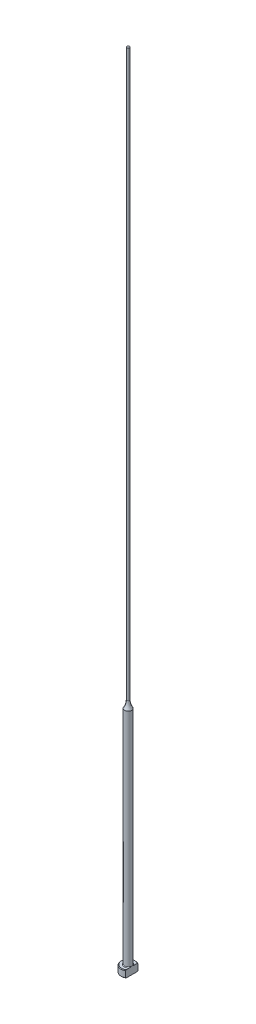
ISO-10303-21;
HEADER;
FILE_DESCRIPTION(('STEP AP214'),'2;1');
FILE_NAME('part.step','',(''),(''),'','','');
FILE_SCHEMA(('AUTOMOTIVE_DESIGN { 1 0 10303 214 1 1 1 1 }'));
ENDSEC;
DATA;
#1=APPLICATION_CONTEXT('core data for automotive mechanical design processes');
#2=APPLICATION_PROTOCOL_DEFINITION('international standard','automotive_design',2000,#1);
#3=PRODUCT_CONTEXT('',#1,'mechanical');
#4=PRODUCT('Part','Part','',(#3));
#5=PRODUCT_RELATED_PRODUCT_CATEGORY('part','',(#4));
#6=PRODUCT_DEFINITION_FORMATION('','',#4);
#7=PRODUCT_DEFINITION_CONTEXT('part definition',#1,'design');
#8=PRODUCT_DEFINITION('design','',#6,#7);
#9=PRODUCT_DEFINITION_SHAPE('','',#8);
#10=(LENGTH_UNIT() NAMED_UNIT(*) SI_UNIT(.MILLI.,.METRE.));
#11=(NAMED_UNIT(*) PLANE_ANGLE_UNIT() SI_UNIT($,.RADIAN.));
#12=(NAMED_UNIT(*) SI_UNIT($,.STERADIAN.) SOLID_ANGLE_UNIT());
#13=UNCERTAINTY_MEASURE_WITH_UNIT(LENGTH_MEASURE(1.E-05),#10,'distance_accuracy_value','');
#14=(GEOMETRIC_REPRESENTATION_CONTEXT(3) GLOBAL_UNCERTAINTY_ASSIGNED_CONTEXT((#13)) GLOBAL_UNIT_ASSIGNED_CONTEXT((#10,
#11,#12)) REPRESENTATION_CONTEXT('',''));
#15=CARTESIAN_POINT('',(0.,0.,0.));
#16=DIRECTION('',(0.,0.,1.));
#17=DIRECTION('',(1.,0.,0.));
#18=AXIS2_PLACEMENT_3D('',#15,#16,#17);
#19=CARTESIAN_POINT('',(-3.17499999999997,3.175,0.));
#20=DIRECTION('',(0.,1.,0.));
#21=DIRECTION('',(0.,0.,1.));
#22=AXIS2_PLACEMENT_3D('',#19,#20,#21);
#23=PLANE('',#22);
#24=CARTESIAN_POINT('',(0.,3.175,0.));
#25=DIRECTION('',(0.,1.,0.));
#26=DIRECTION('',(0.,0.,1.));
#27=AXIS2_PLACEMENT_3D('',#24,#25,#26);
#28=CIRCLE('',#27,2.92099999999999);
#29=CARTESIAN_POINT('',(1.58749999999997,3.175,-2.4519552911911));
#30=VERTEX_POINT('',#29);
#31=CARTESIAN_POINT('',(1.58749999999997,3.175,2.4519552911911));
#32=VERTEX_POINT('',#31);
#33=EDGE_CURVE('E105',#30,#32,#28,.T.);
#34=ORIENTED_EDGE('',*,*,#33,.T.);
#35=DIRECTION('',(0.,0.,1.));
#36=VECTOR('',#35,1.);
#37=CARTESIAN_POINT('',(1.58749999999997,3.17499999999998,2.74963065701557));
#38=LINE('',#37,#36);
#39=CARTESIAN_POINT('',(1.58749999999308,3.175,0.933255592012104));
#40=VERTEX_POINT('',#39);
#41=EDGE_CURVE('E126',#40,#32,#38,.T.);
#42=ORIENTED_EDGE('',*,*,#41,.F.);
#43=CARTESIAN_POINT('',(0.,3.175,0.));
#44=DIRECTION('',(0.,1.,0.));
#45=DIRECTION('',(0.,0.,1.));
#46=AXIS2_PLACEMENT_3D('',#43,#44,#45);
#47=CIRCLE('',#46,1.84149999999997);
#48=CARTESIAN_POINT('',(1.58749999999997,3.17500000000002,-0.933255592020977));
#49=VERTEX_POINT('',#48);
#50=EDGE_CURVE('E11',#40,#49,#47,.F.);
#51=ORIENTED_EDGE('',*,*,#50,.T.);
#52=EDGE_CURVE('E52',#30,#49,#38,.T.);
#53=ORIENTED_EDGE('',*,*,#52,.F.);
#54=EDGE_LOOP('',(#34,#42,#51,#53));
#55=FACE_BOUND('',#54,.T.);
#56=ADVANCED_FACE('F32',(#55),#23,.T.);
#57=CARTESIAN_POINT('',(0.,259.958771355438,0.));
#58=DIRECTION('',(0.,1.,0.));
#59=DIRECTION('',(0.,0.,1.));
#60=AXIS2_PLACEMENT_3D('',#57,#58,#59);
#61=CYLINDRICAL_SURFACE('',#60,3.17499999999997);
#62=CARTESIAN_POINT('',(0.,2.92100000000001,0.));
#63=DIRECTION('',(0.,1.,0.));
#64=DIRECTION('',(0.,0.,1.));
#65=AXIS2_PLACEMENT_3D('',#62,#63,#64);
#66=CIRCLE('',#65,3.17499999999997);
#67=CARTESIAN_POINT('',(1.58749999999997,2.92100000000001,2.74963065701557));
#68=VERTEX_POINT('',#67);
#69=CARTESIAN_POINT('',(1.58749999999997,2.92100000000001,-2.74963065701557));
#70=VERTEX_POINT('',#69);
#71=EDGE_CURVE('E98',#68,#70,#66,.F.);
#72=ORIENTED_EDGE('',*,*,#71,.T.);
#73=DIRECTION('',(0.,-1.,0.));
#74=VECTOR('',#73,1.);
#75=CARTESIAN_POINT('',(1.58749999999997,355.601,-2.74963065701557));
#76=LINE('',#75,#74);
#77=CARTESIAN_POINT('',(1.58749999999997,0.253999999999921,-2.74963065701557));
#78=VERTEX_POINT('',#77);
#79=EDGE_CURVE('E141',#70,#78,#76,.T.);
#80=ORIENTED_EDGE('',*,*,#79,.T.);
#81=CARTESIAN_POINT('',(0.,0.253999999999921,0.));
#82=DIRECTION('',(0.,-1.,0.));
#83=DIRECTION('',(0.,0.,-1.));
#84=AXIS2_PLACEMENT_3D('',#81,#82,#83);
#85=CIRCLE('',#84,3.17499999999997);
#86=CARTESIAN_POINT('',(1.58749999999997,0.253999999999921,2.74963065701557));
#87=VERTEX_POINT('',#86);
#88=EDGE_CURVE('E95',#78,#87,#85,.F.);
#89=ORIENTED_EDGE('',*,*,#88,.T.);
#90=DIRECTION('',(0.,-1.,0.));
#91=VECTOR('',#90,1.);
#92=CARTESIAN_POINT('',(1.58749999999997,355.601,2.74963065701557));
#93=LINE('',#92,#91);
#94=EDGE_CURVE('E88',#68,#87,#93,.T.);
#95=ORIENTED_EDGE('',*,*,#94,.F.);
#96=EDGE_LOOP('',(#72,#80,#89,#95));
#97=FACE_BOUND('',#96,.T.);
#98=ADVANCED_FACE('F191',(#97),#61,.T.);
#99=CARTESIAN_POINT('',(0.,0.,0.));
#100=DIRECTION('',(0.,-1.,0.));
#101=DIRECTION('',(0.,0.,-1.));
#102=AXIS2_PLACEMENT_3D('',#99,#100,#101);
#103=PLANE('',#102);
#104=CARTESIAN_POINT('',(0.,0.,0.));
#105=DIRECTION('',(0.,-1.,0.));
#106=DIRECTION('',(0.,0.,-1.));
#107=AXIS2_PLACEMENT_3D('',#104,#105,#106);
#108=CIRCLE('',#107,2.92100000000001);
#109=CARTESIAN_POINT('',(1.58749999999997,0.,2.45195529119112));
#110=VERTEX_POINT('',#109);
#111=CARTESIAN_POINT('',(1.58749999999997,0.,-2.45195529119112));
#112=VERTEX_POINT('',#111);
#113=EDGE_CURVE('E93',#110,#112,#108,.T.);
#114=ORIENTED_EDGE('',*,*,#113,.T.);
#115=DIRECTION('',(0.,0.,1.));
#116=VECTOR('',#115,1.);
#117=CARTESIAN_POINT('',(1.58749999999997,0.,2.74963065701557));
#118=LINE('',#117,#116);
#119=EDGE_CURVE('E78',#112,#110,#118,.T.);
#120=ORIENTED_EDGE('',*,*,#119,.T.);
#121=EDGE_LOOP('',(#114,#120));
#122=FACE_BOUND('',#121,.T.);
#123=ADVANCED_FACE('F97',(#122),#103,.T.);
#124=CARTESIAN_POINT('',(0.,3.17499999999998,0.));
#125=DIRECTION('',(0.,-1.,0.));
#126=DIRECTION('',(0.,0.,-1.));
#127=AXIS2_PLACEMENT_3D('',#124,#125,#126);
#128=CONICAL_SURFACE('',#127,2.92100000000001,0.785398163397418);
#129=ORIENTED_EDGE('',*,*,#71,.F.);
#130=CARTESIAN_POINT('',(1.58749999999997,-0.161620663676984,-6.0529050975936));
#131=CARTESIAN_POINT('',(1.58749999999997,-0.0288893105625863,-5.91567682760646));
#132=CARTESIAN_POINT('',(1.58749999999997,0.103699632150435,-5.77831035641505));
#133=CARTESIAN_POINT('',(1.58749999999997,0.368508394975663,-5.50321874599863));
#134=CARTESIAN_POINT('',(1.58749999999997,0.5007282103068,-5.3654936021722));
#135=CARTESIAN_POINT('',(1.58749999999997,0.764778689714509,-5.08953516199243));
#136=CARTESIAN_POINT('',(1.58749999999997,0.896609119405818,-4.95130164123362));
#137=CARTESIAN_POINT('',(1.58749999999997,1.15968706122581,-4.67428233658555));
#138=CARTESIAN_POINT('',(1.58749999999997,1.29093457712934,-4.5354965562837));
#139=CARTESIAN_POINT('',(1.58749999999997,1.55007705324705,-4.25997724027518));
#140=CARTESIAN_POINT('',(1.58749999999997,1.67798684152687,-4.12325766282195));
#141=CARTESIAN_POINT('',(1.58749999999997,1.9328486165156,-3.84892898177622));
#142=CARTESIAN_POINT('',(1.58749999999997,2.05980060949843,-3.71131988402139));
#143=CARTESIAN_POINT('',(1.58749999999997,2.31237508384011,-3.43493978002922));
#144=CARTESIAN_POINT('',(1.58749999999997,2.43799784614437,-3.29616903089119));
#145=CARTESIAN_POINT('',(1.58749999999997,2.68741369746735,-3.01699558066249));
#146=CARTESIAN_POINT('',(1.58749999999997,2.81120686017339,-2.8765929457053));
#147=CARTESIAN_POINT('',(1.58749999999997,3.00875865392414,-2.64816703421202));
#148=CARTESIAN_POINT('',(1.58749999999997,3.08336151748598,-2.56087478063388));
#149=CARTESIAN_POINT('',(1.58749999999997,3.23123871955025,-2.385154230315));
#150=CARTESIAN_POINT('',(1.58749999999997,3.30451292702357,-2.29672582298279));
#151=CARTESIAN_POINT('',(1.58749999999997,3.45004422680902,-2.11747400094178));
#152=CARTESIAN_POINT('',(1.58749999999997,3.52228237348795,-2.02663514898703));
#153=CARTESIAN_POINT('',(1.58749999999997,3.66423097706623,-1.84302524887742));
#154=CARTESIAN_POINT('',(1.58749999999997,3.73394203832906,-1.75025467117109));
#155=CARTESIAN_POINT('',(1.58749999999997,3.87080633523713,-1.56067475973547));
#156=CARTESIAN_POINT('',(1.58749999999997,3.93790459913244,-1.46382547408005));
#157=CARTESIAN_POINT('',(1.58749999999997,4.06669147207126,-1.26632594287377));
#158=CARTESIAN_POINT('',(1.58749999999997,4.12837264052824,-1.16567073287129));
#159=CARTESIAN_POINT('',(1.58749999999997,4.21402252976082,-1.01165766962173));
#160=CARTESIAN_POINT('',(1.58749999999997,4.2412792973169,-0.960142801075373));
#161=CARTESIAN_POINT('',(1.58749999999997,4.29309798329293,-0.85578092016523));
#162=CARTESIAN_POINT('',(1.58749999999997,4.3176594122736,-0.802933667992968));
#163=CARTESIAN_POINT('',(1.58749999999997,4.38614656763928,-0.642461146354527));
#164=CARTESIAN_POINT('',(1.58749999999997,4.42510149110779,-0.532518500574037));
#165=CARTESIAN_POINT('',(1.58749999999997,4.46726244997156,-0.367680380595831));
#166=CARTESIAN_POINT('',(1.58749999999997,4.47844427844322,-0.314802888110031));
#167=CARTESIAN_POINT('',(1.58749999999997,4.49576654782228,-0.208209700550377));
#168=CARTESIAN_POINT('',(1.58749999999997,4.50190743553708,-0.154494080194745));
#169=CARTESIAN_POINT('',(1.58749999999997,4.50871296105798,-0.0468792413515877));
#170=CARTESIAN_POINT('',(1.58749999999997,4.50939451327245,0.00701889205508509));
#171=CARTESIAN_POINT('',(1.58749999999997,4.5052767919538,0.114606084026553));
#172=CARTESIAN_POINT('',(1.58749999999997,4.5004770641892,0.16829512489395));
#173=CARTESIAN_POINT('',(1.58749999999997,4.48579689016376,0.274485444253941));
#174=CARTESIAN_POINT('',(1.58749999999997,4.47596081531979,0.326992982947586));
#175=CARTESIAN_POINT('',(1.58749999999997,4.4518180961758,0.430974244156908));
#176=CARTESIAN_POINT('',(1.58749999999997,4.43750969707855,0.482447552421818));
#177=CARTESIAN_POINT('',(1.58749999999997,4.40502489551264,0.58446088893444));
#178=CARTESIAN_POINT('',(1.58749999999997,4.38682724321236,0.634994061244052));
#179=CARTESIAN_POINT('',(1.58749999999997,4.34729308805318,0.734789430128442));
#180=CARTESIAN_POINT('',(1.58749999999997,4.32595722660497,0.784051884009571));
#181=CARTESIAN_POINT('',(1.58749999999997,4.25791922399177,0.93054934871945));
#182=CARTESIAN_POINT('',(1.58749999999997,4.20736047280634,1.02598802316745));
#183=CARTESIAN_POINT('',(1.58749999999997,4.09955451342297,1.21304313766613));
#184=CARTESIAN_POINT('',(1.58749999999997,4.04229912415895,1.30465471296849));
#185=CARTESIAN_POINT('',(1.58749999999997,3.92308746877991,1.48526211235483));
#186=CARTESIAN_POINT('',(1.58749999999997,3.86111349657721,1.57424615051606));
#187=CARTESIAN_POINT('',(1.58749999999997,3.73408621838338,1.74990003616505));
#188=CARTESIAN_POINT('',(1.58749999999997,3.66903444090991,1.83657099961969));
#189=CARTESIAN_POINT('',(1.58749999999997,3.53583371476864,2.009317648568));
#190=CARTESIAN_POINT('',(1.58749999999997,3.46765527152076,2.09537048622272));
#191=CARTESIAN_POINT('',(1.58749999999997,3.32960643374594,2.26611736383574));
#192=CARTESIAN_POINT('',(1.58749999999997,3.25973586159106,2.35081125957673));
#193=CARTESIAN_POINT('',(1.58749999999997,3.04858139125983,2.60290121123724));
#194=CARTESIAN_POINT('',(1.58749999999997,2.90542388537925,2.7687253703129));
#195=CARTESIAN_POINT('',(1.58749999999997,2.64069522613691,3.06970913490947));
#196=CARTESIAN_POINT('',(1.58749999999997,2.5195945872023,3.20528660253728));
#197=CARTESIAN_POINT('',(1.58749999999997,2.27590400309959,3.47510321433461));
#198=CARTESIAN_POINT('',(1.58749999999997,2.1533140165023,3.60934232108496));
#199=CARTESIAN_POINT('',(1.58749999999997,1.9069423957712,3.87695374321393));
#200=CARTESIAN_POINT('',(1.58749999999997,1.78315974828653,4.01032512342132));
#201=CARTESIAN_POINT('',(1.58749999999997,1.53478104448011,4.2763088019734));
#202=CARTESIAN_POINT('',(1.58749999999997,1.41018498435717,4.40892109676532));
#203=CARTESIAN_POINT('',(1.58749999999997,1.04574684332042,4.79499418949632));
#204=CARTESIAN_POINT('',(1.58749999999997,0.805076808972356,5.04767313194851));
#205=CARTESIAN_POINT('',(1.58749999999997,0.44312150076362,5.42550911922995));
#206=CARTESIAN_POINT('',(1.58749999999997,0.322378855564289,5.55118772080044));
#207=CARTESIAN_POINT('',(1.58749999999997,0.0805914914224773,5.8022520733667));
#208=CARTESIAN_POINT('',(1.58749999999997,-0.0404532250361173,5.92763782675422));
#209=CARTESIAN_POINT('',(1.58749999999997,-0.161620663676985,6.0529050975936));
#210=B_SPLINE_CURVE_WITH_KNOTS('',3,(#130,#131,#132,#133,#134,#135,#136,#137,#138,#139,#140,
#141,#142,#143,#144,#145,#146,#147,#148,#149,#150,#151,#152,#153,#154,#155,#156,#157,#158,#159,
#160,#161,#162,#163,#164,#165,#166,#167,#168,#169,#170,#171,#172,#173,#174,#175,#176,#177,#178,
#179,#180,#181,#182,#183,#184,#185,#186,#187,#188,#189,#190,#191,#192,#193,#194,#195,#196,#197,
#198,#199,#200,#201,#202,#203,#204,#205,#206,#207,#208,#209),.UNSPECIFIED.,.F.,.F.,(4,2,2,2,2,2,
2,2,2,2,2,2,2,2,2,2,2,2,2,2,2,2,2,2,2,2,2,2,2,2,2,2,2,2,2,2,2,2,2,4),(0.,0.572750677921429,
1.14550874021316,1.71856057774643,2.29160869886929,2.85328006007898,3.41494773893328,
3.97649423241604,4.53801804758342,4.88249307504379,5.2270018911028,5.57515326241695,
5.92322081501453,6.27657800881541,6.63041319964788,6.80518126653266,6.97998101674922,
7.32824262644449,7.49018491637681,7.65211285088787,7.81353889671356,7.97497832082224,
8.13501929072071,8.29512313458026,8.45612518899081,8.61709438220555,8.94062993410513,
9.26456495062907,9.58978187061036,9.91483894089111,10.2441741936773,10.5735441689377,
11.2306812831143,11.7760337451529,12.3214014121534,12.8672825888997,13.4131663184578,
14.4600164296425,14.9828595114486,15.505698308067),.UNSPECIFIED.);
#211=EDGE_CURVE('E118',#32,#68,#210,.T.);
#212=ORIENTED_EDGE('',*,*,#211,.F.);
#213=ORIENTED_EDGE('',*,*,#33,.F.);
#214=EDGE_CURVE('E117',#70,#30,#210,.T.);
#215=ORIENTED_EDGE('',*,*,#214,.F.);
#216=EDGE_LOOP('',(#129,#212,#213,#215));
#217=FACE_BOUND('',#216,.T.);
#218=ADVANCED_FACE('F162',(#217),#128,.T.);
#219=CARTESIAN_POINT('',(0.,0.253999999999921,0.));
#220=DIRECTION('',(0.,1.,0.));
#221=DIRECTION('',(0.,0.,1.));
#222=AXIS2_PLACEMENT_3D('',#219,#220,#221);
#223=CONICAL_SURFACE('',#222,3.17499999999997,0.785398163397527);
#224=ORIENTED_EDGE('',*,*,#88,.F.);
#225=CARTESIAN_POINT('',(1.58749999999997,3.33662066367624,6.0529050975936));
#226=CARTESIAN_POINT('',(1.58749999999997,3.20388931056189,5.91567682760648));
#227=CARTESIAN_POINT('',(1.58749999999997,3.07130036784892,5.7783103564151));
#228=CARTESIAN_POINT('',(1.58749999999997,2.80649160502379,5.50321874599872));
#229=CARTESIAN_POINT('',(1.58749999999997,2.6742717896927,5.36549360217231));
#230=CARTESIAN_POINT('',(1.58749999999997,2.41022131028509,5.08953516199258));
#231=CARTESIAN_POINT('',(1.58749999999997,2.27839088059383,4.95130164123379));
#232=CARTESIAN_POINT('',(1.58749999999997,2.01531293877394,4.67428233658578));
#233=CARTESIAN_POINT('',(1.58749999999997,1.88406542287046,4.53549655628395));
#234=CARTESIAN_POINT('',(1.58749999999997,1.62492294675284,4.25997724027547));
#235=CARTESIAN_POINT('',(1.58749999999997,1.49701315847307,4.12325766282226));
#236=CARTESIAN_POINT('',(1.58749999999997,1.24215138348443,3.84892898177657));
#237=CARTESIAN_POINT('',(1.58749999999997,1.11519939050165,3.71131988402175));
#238=CARTESIAN_POINT('',(1.58749999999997,0.862624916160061,3.43493978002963));
#239=CARTESIAN_POINT('',(1.58749999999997,0.737002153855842,3.29616903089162));
#240=CARTESIAN_POINT('',(1.58749999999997,0.487586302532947,3.01699558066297));
#241=CARTESIAN_POINT('',(1.58749999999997,0.363793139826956,2.8765929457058));
#242=CARTESIAN_POINT('',(1.58749999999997,0.166241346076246,2.64816703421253));
#243=CARTESIAN_POINT('',(1.58749999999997,0.0916384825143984,2.56087478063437));
#244=CARTESIAN_POINT('',(1.58749999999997,-0.0562387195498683,2.38515423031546));
#245=CARTESIAN_POINT('',(1.58749999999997,-0.129512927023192,2.29672582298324));
#246=CARTESIAN_POINT('',(1.58749999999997,-0.275044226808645,2.1174740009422));
#247=CARTESIAN_POINT('',(1.58749999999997,-0.347282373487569,2.02663514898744));
#248=CARTESIAN_POINT('',(1.58749999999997,-0.489230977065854,1.8430252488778));
#249=CARTESIAN_POINT('',(1.58749999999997,-0.558942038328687,1.75025467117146));
#250=CARTESIAN_POINT('',(1.58749999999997,-0.695806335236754,1.5606747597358));
#251=CARTESIAN_POINT('',(1.58749999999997,-0.762904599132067,1.46382547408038));
#252=CARTESIAN_POINT('',(1.58749999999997,-0.89169147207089,1.26632594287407));
#253=CARTESIAN_POINT('',(1.58749999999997,-0.953372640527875,1.16567073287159));
#254=CARTESIAN_POINT('',(1.58749999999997,-1.03902252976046,1.01165766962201));
#255=CARTESIAN_POINT('',(1.58749999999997,-1.06627929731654,0.960142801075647));
#256=CARTESIAN_POINT('',(1.58749999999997,-1.11809798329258,0.855780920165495));
#257=CARTESIAN_POINT('',(1.58749999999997,-1.14265941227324,0.802933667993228));
#258=CARTESIAN_POINT('',(1.58749999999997,-1.21114656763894,0.642461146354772));
#259=CARTESIAN_POINT('',(1.58749999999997,-1.25010149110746,0.532518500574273));
#260=CARTESIAN_POINT('',(1.58749999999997,-1.29226244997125,0.367680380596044));
#261=CARTESIAN_POINT('',(1.58749999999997,-1.30344427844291,0.314802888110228));
#262=CARTESIAN_POINT('',(1.58749999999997,-1.32076654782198,0.208209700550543));
#263=CARTESIAN_POINT('',(1.58749999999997,-1.32690743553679,0.154494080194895));
#264=CARTESIAN_POINT('',(1.58749999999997,-1.3337129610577,0.0468792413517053));
#265=CARTESIAN_POINT('',(1.58749999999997,-1.33439451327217,-0.00701889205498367));
#266=CARTESIAN_POINT('',(1.58749999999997,-1.33027679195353,-0.114606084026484));
#267=CARTESIAN_POINT('',(1.58749999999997,-1.32547706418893,-0.168295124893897));
#268=CARTESIAN_POINT('',(1.58749999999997,-1.31079689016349,-0.274485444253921));
#269=CARTESIAN_POINT('',(1.58749999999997,-1.30096081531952,-0.326992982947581));
#270=CARTESIAN_POINT('',(1.58749999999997,-1.27681809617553,-0.430974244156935));
#271=CARTESIAN_POINT('',(1.58749999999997,-1.26250969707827,-0.48244755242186));
#272=CARTESIAN_POINT('',(1.58749999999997,-1.23002489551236,-0.584460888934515));
#273=CARTESIAN_POINT('',(1.58749999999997,-1.21182724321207,-0.634994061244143));
#274=CARTESIAN_POINT('',(1.58749999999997,-1.17229308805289,-0.734789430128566));
#275=CARTESIAN_POINT('',(1.58749999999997,-1.15095722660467,-0.784051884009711));
#276=CARTESIAN_POINT('',(1.58749999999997,-1.08291922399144,-0.930549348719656));
#277=CARTESIAN_POINT('',(1.58749999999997,-1.03236047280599,-1.0259880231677));
#278=CARTESIAN_POINT('',(1.58749999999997,-0.924554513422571,-1.21304313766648));
#279=CARTESIAN_POINT('',(1.58749999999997,-0.867299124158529,-1.30465471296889));
#280=CARTESIAN_POINT('',(1.58749999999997,-0.748087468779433,-1.48526211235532));
#281=CARTESIAN_POINT('',(1.58749999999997,-0.686113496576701,-1.5742461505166));
#282=CARTESIAN_POINT('',(1.58749999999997,-0.559086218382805,-1.74990003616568));
#283=CARTESIAN_POINT('',(1.58749999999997,-0.494034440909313,-1.83657099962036));
#284=CARTESIAN_POINT('',(1.58749999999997,-0.360833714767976,-2.00931764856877));
#285=CARTESIAN_POINT('',(1.58749999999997,-0.292655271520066,-2.09537048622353));
#286=CARTESIAN_POINT('',(1.58749999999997,-0.154606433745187,-2.26611736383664));
#287=CARTESIAN_POINT('',(1.58749999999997,-0.0847358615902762,-2.35081125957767));
#288=CARTESIAN_POINT('',(1.58749999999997,0.126418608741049,-2.60290121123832));
#289=CARTESIAN_POINT('',(1.58749999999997,0.269576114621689,-2.76872537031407));
#290=CARTESIAN_POINT('',(1.58749999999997,0.534304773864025,-3.06970913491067));
#291=CARTESIAN_POINT('',(1.58749999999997,0.655405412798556,-3.20528660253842));
#292=CARTESIAN_POINT('',(1.58749999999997,0.899095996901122,-3.47510321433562));
#293=CARTESIAN_POINT('',(1.58749999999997,1.02168598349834,-3.60934232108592));
#294=CARTESIAN_POINT('',(1.58749999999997,1.26805760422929,-3.87695374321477));
#295=CARTESIAN_POINT('',(1.58749999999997,1.39184025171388,-4.0103251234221));
#296=CARTESIAN_POINT('',(1.58749999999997,1.64021895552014,-4.27630880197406));
#297=CARTESIAN_POINT('',(1.58749999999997,1.76481501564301,-4.40892109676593));
#298=CARTESIAN_POINT('',(1.58749999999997,2.12925315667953,-4.79499418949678));
#299=CARTESIAN_POINT('',(1.58749999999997,2.36992319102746,-5.04767313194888));
#300=CARTESIAN_POINT('',(1.58749999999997,2.73187849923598,-5.42550911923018));
#301=CARTESIAN_POINT('',(1.58749999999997,2.85262114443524,-5.55118772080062));
#302=CARTESIAN_POINT('',(1.58749999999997,3.09440850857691,-5.80225207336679));
#303=CARTESIAN_POINT('',(1.58749999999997,3.21545322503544,-5.92763782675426));
#304=CARTESIAN_POINT('',(1.58749999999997,3.33662066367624,-6.0529050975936));
#305=B_SPLINE_CURVE_WITH_KNOTS('',3,(#225,#226,#227,#228,#229,#230,#231,#232,#233,#234,#235,
#236,#237,#238,#239,#240,#241,#242,#243,#244,#245,#246,#247,#248,#249,#250,#251,#252,#253,#254,
#255,#256,#257,#258,#259,#260,#261,#262,#263,#264,#265,#266,#267,#268,#269,#270,#271,#272,#273,
#274,#275,#276,#277,#278,#279,#280,#281,#282,#283,#284,#285,#286,#287,#288,#289,#290,#291,#292,
#293,#294,#295,#296,#297,#298,#299,#300,#301,#302,#303,#304),.UNSPECIFIED.,.F.,.F.,(4,2,2,2,2,2,
2,2,2,2,2,2,2,2,2,2,2,2,2,2,2,2,2,2,2,2,2,2,2,2,2,2,2,2,2,2,2,2,2,4),(0.,0.572750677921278,
1.14550874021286,1.71856057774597,2.29160869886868,2.85328006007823,3.4149477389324,
3.97649423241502,4.53801804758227,4.88249307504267,5.22700189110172,5.5751532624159,
5.92322081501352,6.27657800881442,6.63041319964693,6.80518126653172,6.9799810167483,
7.3282426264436,7.49018491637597,7.65211285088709,7.81353889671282,7.97497832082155,
8.13501929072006,8.29512313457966,8.45612518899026,8.61709438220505,8.9406299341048,
9.2645649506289,9.58978187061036,9.91483894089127,10.2441741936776,10.5735441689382,
11.2306812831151,11.7760337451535,12.3214014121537,12.8672825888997,13.4131663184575,
14.4600164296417,14.9828595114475,15.5056983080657),.UNSPECIFIED.);
#306=EDGE_CURVE('E81',#112,#78,#305,.T.);
#307=ORIENTED_EDGE('',*,*,#306,.F.);
#308=ORIENTED_EDGE('',*,*,#113,.F.);
#309=EDGE_CURVE('E84',#87,#110,#305,.T.);
#310=ORIENTED_EDGE('',*,*,#309,.F.);
#311=EDGE_LOOP('',(#224,#307,#308,#310));
#312=FACE_BOUND('',#311,.T.);
#313=ADVANCED_FACE('F92',(#312),#223,.T.);
#314=CARTESIAN_POINT('',(0.,3.42900000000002,0.));
#315=DIRECTION('',(0.,1.,0.));
#316=DIRECTION('',(0.,0.,1.));
#317=AXIS2_PLACEMENT_3D('',#314,#315,#316);
#318=TOROIDAL_SURFACE('',#317,1.84149999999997,0.254);
#319=CARTESIAN_POINT('',(1.58749999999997,3.42900000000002,0.));
#320=CARTESIAN_POINT('',(1.58749999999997,3.42899942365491,-1.9220514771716E-10));
#321=CARTESIAN_POINT('',(1.58749999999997,3.42899884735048,-1.2261161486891E-07));
#322=CARTESIAN_POINT('',(1.58749999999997,3.42899773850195,-5.09676365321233E-07));
#323=CARTESIAN_POINT('',(1.58749999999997,3.42899720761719,-7.78176328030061E-07));
#324=CARTESIAN_POINT('',(1.58749999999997,3.42899614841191,-1.42307272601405E-06));
#325=CARTESIAN_POINT('',(1.58749999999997,3.42899562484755,-1.80713867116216E-06));
#326=CARTESIAN_POINT('',(1.58749999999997,3.42899463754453,-2.63494846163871E-06));
#327=CARTESIAN_POINT('',(1.58749999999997,3.42899417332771,-3.07814756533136E-06));
#328=CARTESIAN_POINT('',(1.58749999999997,3.42899261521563,-4.66897357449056E-06));
#329=CARTESIAN_POINT('',(1.58749999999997,3.42899159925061,-5.89404908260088E-06));
#330=CARTESIAN_POINT('',(1.58749999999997,3.42898979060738,-8.42427511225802E-06));
#331=CARTESIAN_POINT('',(1.58749999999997,3.42898899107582,-9.7248057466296E-06));
#332=CARTESIAN_POINT('',(1.58749999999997,3.42898598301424,-1.48060601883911E-05));
#333=CARTESIAN_POINT('',(1.58749999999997,3.42898393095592,-1.86838281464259E-05));
#334=CARTESIAN_POINT('',(1.58749999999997,3.42898057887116,-2.63261117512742E-05));
#335=CARTESIAN_POINT('',(1.58749999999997,3.42897922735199,-3.00687417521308E-05));
#336=CARTESIAN_POINT('',(1.58749999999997,3.42897347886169,-4.60276298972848E-05));
#337=CARTESIAN_POINT('',(1.58749999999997,3.42896911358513,-5.8247019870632E-05));
#338=CARTESIAN_POINT('',(1.58749999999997,3.42896211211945,-8.11070097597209E-05));
#339=CARTESIAN_POINT('',(1.58749999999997,3.42895931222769,-9.16953114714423E-05));
#340=CARTESIAN_POINT('',(1.58749999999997,3.42893712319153,-0.000168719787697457));
#341=CARTESIAN_POINT('',(1.58749999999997,3.42890881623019,-0.000232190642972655));
#342=CARTESIAN_POINT('',(1.58749999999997,3.42880276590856,-0.000479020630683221));
#343=CARTESIAN_POINT('',(1.58749999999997,3.42873165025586,-0.00066443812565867));
#344=CARTESIAN_POINT('',(1.58749999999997,3.42845137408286,-0.0013844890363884));
#345=CARTESIAN_POINT('',(1.58749999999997,3.42823526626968,-0.00191701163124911));
#346=CARTESIAN_POINT('',(1.58749999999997,3.42735449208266,-0.00409774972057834));
#347=CARTESIAN_POINT('',(1.58749999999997,3.42669768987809,-0.00574830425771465));
#348=CARTESIAN_POINT('',(1.58749999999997,3.4174405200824,-0.0289985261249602));
#349=CARTESIAN_POINT('',(1.58749999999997,3.40878325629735,-0.0505816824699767));
#350=CARTESIAN_POINT('',(1.58749999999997,3.39189297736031,-0.0929947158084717));
#351=CARTESIAN_POINT('',(1.58749999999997,3.38365605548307,-0.11382315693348));
#352=CARTESIAN_POINT('',(1.58749999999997,3.36635393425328,-0.157956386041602));
#353=CARTESIAN_POINT('',(1.58749999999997,3.35730391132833,-0.181267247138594));
#354=CARTESIAN_POINT('',(1.58749999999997,3.33936775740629,-0.228222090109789));
#355=CARTESIAN_POINT('',(1.58749999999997,3.33048420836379,-0.25186705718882));
#356=CARTESIAN_POINT('',(1.58749999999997,3.30894496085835,-0.310512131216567));
#357=CARTESIAN_POINT('',(1.58749999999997,3.29649449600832,-0.345588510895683));
#358=CARTESIAN_POINT('',(1.58749999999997,3.27296975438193,-0.415278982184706));
#359=CARTESIAN_POINT('',(1.58749999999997,3.26186987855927,-0.449884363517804));
#360=CARTESIAN_POINT('',(1.58749999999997,3.2395832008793,-0.524471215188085));
#361=CARTESIAN_POINT('',(1.58749999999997,3.22860862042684,-0.564517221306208));
#362=CARTESIAN_POINT('',(1.58749999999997,3.20902534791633,-0.645529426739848));
#363=CARTESIAN_POINT('',(1.58749999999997,3.20043582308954,-0.686500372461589));
#364=CARTESIAN_POINT('',(1.58749999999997,3.18611712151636,-0.771546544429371));
#365=CARTESIAN_POINT('',(1.58749999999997,3.18059550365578,-0.815658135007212));
#366=CARTESIAN_POINT('',(1.58749999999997,3.17455396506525,-0.904117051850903));
#367=CARTESIAN_POINT('',(1.58749999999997,3.17401361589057,-0.948462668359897));
#368=CARTESIAN_POINT('',(1.58749999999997,3.17898948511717,-1.02531896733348));
#369=CARTESIAN_POINT('',(1.58749999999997,3.1829739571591,-1.05792141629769));
#370=CARTESIAN_POINT('',(1.58749999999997,3.19569167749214,-1.12184393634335));
#371=CARTESIAN_POINT('',(1.58749999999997,3.20436049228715,-1.1531753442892));
#372=CARTESIAN_POINT('',(1.58749999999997,3.22236152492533,-1.19946468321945));
#373=CARTESIAN_POINT('',(1.58749999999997,3.2295150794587,-1.21526783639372));
#374=CARTESIAN_POINT('',(1.58749999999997,3.24587062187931,-1.24583726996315));
#375=CARTESIAN_POINT('',(1.58749999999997,3.25507530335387,-1.26060215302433));
#376=CARTESIAN_POINT('',(1.58749999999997,3.27378481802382,-1.28575815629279));
#377=CARTESIAN_POINT('',(1.58749999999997,3.28289001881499,-1.29644383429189));
#378=CARTESIAN_POINT('',(1.58749999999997,3.30268460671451,-1.31623154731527));
#379=CARTESIAN_POINT('',(1.58749999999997,3.31337067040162,-1.32533681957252));
#380=CARTESIAN_POINT('',(1.58749999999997,3.33349977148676,-1.33941140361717));
#381=CARTESIAN_POINT('',(1.58749999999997,3.34261446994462,-1.34484814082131));
#382=CARTESIAN_POINT('',(1.58749999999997,3.36161455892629,-1.35416329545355));
#383=CARTESIAN_POINT('',(1.58749999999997,3.37149946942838,-1.35804267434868));
#384=CARTESIAN_POINT('',(1.58749999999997,3.39188678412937,-1.36398436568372));
#385=CARTESIAN_POINT('',(1.58749999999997,3.40239309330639,-1.36603350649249));
#386=CARTESIAN_POINT('',(1.58749999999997,3.42360372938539,-1.3680840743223));
#387=CARTESIAN_POINT('',(1.58749999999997,3.43430795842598,-1.36808648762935));
#388=CARTESIAN_POINT('',(1.58749999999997,3.45433283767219,-1.36616208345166));
#389=CARTESIAN_POINT('',(1.58749999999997,3.46367506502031,-1.36444960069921));
#390=CARTESIAN_POINT('',(1.58749999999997,3.48195519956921,-1.35953338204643));
#391=CARTESIAN_POINT('',(1.58749999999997,3.49089304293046,-1.3563294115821));
#392=CARTESIAN_POINT('',(1.58749999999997,3.50850302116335,-1.34848006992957));
#393=CARTESIAN_POINT('',(1.58749999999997,3.5171531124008,-1.34378578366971));
#394=CARTESIAN_POINT('',(1.58749999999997,3.53371257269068,-1.33324445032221));
#395=CARTESIAN_POINT('',(1.58749999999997,3.54162163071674,-1.32739692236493));
#396=CARTESIAN_POINT('',(1.58749999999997,3.56107121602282,-1.31107304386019));
#397=CARTESIAN_POINT('',(1.58749999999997,3.57202221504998,-1.29989286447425));
#398=CARTESIAN_POINT('',(1.58749999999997,3.59202509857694,-1.27593566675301));
#399=CARTESIAN_POINT('',(1.58749999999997,3.60107086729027,-1.26315370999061));
#400=CARTESIAN_POINT('',(1.58749999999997,3.62186023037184,-1.22930733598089));
#401=CARTESIAN_POINT('',(1.58749999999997,3.63240584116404,-1.20751096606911));
#402=CARTESIAN_POINT('',(1.58749999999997,3.65004643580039,-1.16266144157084));
#403=CARTESIAN_POINT('',(1.58749999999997,3.65714435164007,-1.13960937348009));
#404=CARTESIAN_POINT('',(1.58749999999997,3.67265428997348,-1.07603916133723));
#405=CARTESIAN_POINT('',(1.58749999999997,3.67834921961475,-1.03486686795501));
#406=CARTESIAN_POINT('',(1.58749999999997,3.68382880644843,-0.951558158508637));
#407=CARTESIAN_POINT('',(1.58749999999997,3.68350976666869,-0.909417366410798));
#408=CARTESIAN_POINT('',(1.58749999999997,3.67745397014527,-0.811383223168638));
#409=CARTESIAN_POINT('',(1.58749999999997,3.66993873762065,-0.755610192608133));
#410=CARTESIAN_POINT('',(1.58749999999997,3.64933373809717,-0.644937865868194));
#411=CARTESIAN_POINT('',(1.58749999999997,3.63621897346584,-0.59004364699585));
#412=CARTESIAN_POINT('',(1.58749999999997,3.60740922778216,-0.485757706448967));
#413=CARTESIAN_POINT('',(1.58749999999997,3.59201096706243,-0.436281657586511));
#414=CARTESIAN_POINT('',(1.58749999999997,3.55922497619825,-0.338551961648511));
#415=CARTESIAN_POINT('',(1.58749999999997,3.5418584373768,-0.290291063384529));
#416=CARTESIAN_POINT('',(1.58749999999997,3.51760237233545,-0.225557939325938));
#417=CARTESIAN_POINT('',(1.58749999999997,3.51126413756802,-0.208874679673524));
#418=CARTESIAN_POINT('',(1.58749999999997,3.49830042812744,-0.17512392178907));
#419=CARTESIAN_POINT('',(1.58749999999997,3.49167176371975,-0.158057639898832));
#420=CARTESIAN_POINT('',(1.58749999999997,3.47585523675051,-0.117638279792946));
#421=CARTESIAN_POINT('',(1.58749999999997,3.46662970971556,-0.0943002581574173));
#422=CARTESIAN_POINT('',(1.58749999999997,3.44889695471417,-0.0497824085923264));
#423=CARTESIAN_POINT('',(1.58749999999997,3.44040039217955,-0.028598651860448));
#424=CARTESIAN_POINT('',(1.58749999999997,3.43130364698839,-0.00575168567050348));
#425=CARTESIAN_POINT('',(1.58749999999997,3.43064818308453,-0.00410451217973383));
#426=CARTESIAN_POINT('',(1.58749999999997,3.42976776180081,-0.00192459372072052));
#427=CARTESIAN_POINT('',(1.58749999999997,3.42955062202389,-0.00138952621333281));
#428=CARTESIAN_POINT('',(1.58749999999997,3.42926908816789,-0.000666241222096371));
#429=CARTESIAN_POINT('',(1.58749999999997,3.42919771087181,-0.000480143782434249));
#430=CARTESIAN_POINT('',(1.58749999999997,3.42909131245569,-0.000232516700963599));
#431=CARTESIAN_POINT('',(1.58749999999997,3.42906294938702,-0.000168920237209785));
#432=CARTESIAN_POINT('',(1.58749999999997,3.42904072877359,-9.17527162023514E-05));
#433=CARTESIAN_POINT('',(1.58749999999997,3.42903792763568,-8.11550293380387E-05));
#434=CARTESIAN_POINT('',(1.58749999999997,3.42903091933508,-5.82743948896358E-05));
#435=CARTESIAN_POINT('',(1.58749999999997,3.42902654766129,-4.60440001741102E-05));
#436=CARTESIAN_POINT('',(1.58749999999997,3.42902079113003,-3.00727682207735E-05));
#437=CARTESIAN_POINT('',(1.58749999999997,3.42901943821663,-2.63286807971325E-05));
#438=CARTESIAN_POINT('',(1.58749999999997,3.42901608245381,-1.86836529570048E-05));
#439=CARTESIAN_POINT('',(1.58749999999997,3.4290140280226,-1.48046517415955E-05));
#440=CARTESIAN_POINT('',(1.58749999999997,3.42901101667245,-9.72223943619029E-06));
#441=CARTESIAN_POINT('',(1.58749999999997,3.42901021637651,-8.42159649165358E-06));
#442=CARTESIAN_POINT('',(1.58749999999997,3.42900840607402,-5.89129729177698E-06));
#443=CARTESIAN_POINT('',(1.58749999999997,3.42900738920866,-4.66626867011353E-06));
#444=CARTESIAN_POINT('',(1.58749999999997,3.42900582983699,-3.07568803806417E-06));
#445=CARTESIAN_POINT('',(1.58749999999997,3.42900536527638,-2.63259565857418E-06));
#446=CARTESIAN_POINT('',(1.58749999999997,3.4290043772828,-1.80506085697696E-06));
#447=CARTESIAN_POINT('',(1.58749999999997,3.42900385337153,-1.42116387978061E-06));
#448=CARTESIAN_POINT('',(1.58749999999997,3.42900279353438,-7.76675643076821E-07));
#449=CARTESIAN_POINT('',(1.58749999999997,3.42900226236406,-5.08406487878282E-07));
#450=CARTESIAN_POINT('',(1.58749999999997,3.42900115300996,-1.21901887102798E-07));
#451=CARTESIAN_POINT('',(1.58749999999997,3.42900057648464,1.92251677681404E-10));
#452=CARTESIAN_POINT('',(1.58749999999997,3.42900000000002,0.));
#453=B_SPLINE_CURVE_WITH_KNOTS('',3,(#319,#320,#321,#322,#323,#324,#325,#326,#327,#328,#329,
#330,#331,#332,#333,#334,#335,#336,#337,#338,#339,#340,#341,#342,#343,#344,#345,#346,#347,#348,
#349,#350,#351,#352,#353,#354,#355,#356,#357,#358,#359,#360,#361,#362,#363,#364,#365,#366,#367,
#368,#369,#370,#371,#372,#373,#374,#375,#376,#377,#378,#379,#380,#381,#382,#383,#384,#385,#386,
#387,#388,#389,#390,#391,#392,#393,#394,#395,#396,#397,#398,#399,#400,#401,#402,#403,#404,#405,
#406,#407,#408,#409,#410,#411,#412,#413,#414,#415,#416,#417,#418,#419,#420,#421,#422,#423,#424,
#425,#426,#427,#428,#429,#430,#431,#432,#433,#434,#435,#436,#437,#438,#439,#440,#441,#442,#443,
#444,#445,#446,#447,#448,#449,#450,#451,#452),.UNSPECIFIED.,.T.,.F.,(4,2,2,2,2,2,2,2,2,2,2,2,2,
2,2,2,2,2,2,2,2,2,2,2,2,2,2,2,2,2,2,2,2,2,2,2,2,2,2,2,2,2,2,2,2,2,2,2,2,2,2,2,2,2,2,2,2,2,2,2,2,
2,2,2,2,2,4),(0.,1.72815458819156E-06,3.50429255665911E-06,5.44431004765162E-06,
7.3675525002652E-06,1.2119089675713E-05,1.66953775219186E-05,2.98160400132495E-05,
4.17409564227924E-05,8.0660475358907E-05,0.000113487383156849,0.000321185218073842,
0.000917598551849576,0.00264089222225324,0.00797105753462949,0.0777276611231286,
0.144923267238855,0.219939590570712,0.295714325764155,0.407362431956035,0.516367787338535,
0.640878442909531,0.766362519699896,0.899536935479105,1.03216495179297,1.13045740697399,
1.22743103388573,1.27935899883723,1.33135556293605,1.37333248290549,1.41522237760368,
1.44693946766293,1.47863694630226,1.51056074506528,1.54246916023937,1.57083210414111,
1.59919951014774,1.62861579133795,1.65804436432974,1.70472658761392,1.75155645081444,
1.82378709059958,1.89595619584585,2.01995471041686,2.1460932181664,2.31447224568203,
2.48361094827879,2.6389891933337,2.79283011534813,2.84637031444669,2.9012946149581,
2.97658236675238,3.04504771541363,3.05036697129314,3.05209849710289,3.05269709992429,
3.05290520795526,3.05293806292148,3.05297701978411,3.05298895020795,3.05300207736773,
3.05300665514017,3.0530114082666,3.05301333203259,3.05301527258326,3.05301704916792,
3.05301877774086),.UNSPECIFIED.);
#454=CARTESIAN_POINT('',(1.58749999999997,3.42900000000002,0.));
#455=VERTEX_POINT('',#454);
#456=EDGE_CURVE('E47',#455,#49,#453,.T.);
#457=ORIENTED_EDGE('',*,*,#456,.T.);
#458=ORIENTED_EDGE('',*,*,#50,.F.);
#459=CARTESIAN_POINT('',(1.58749999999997,3.42900000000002,0.));
#460=CARTESIAN_POINT('',(1.58749999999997,3.42900057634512,1.9220512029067E-10));
#461=CARTESIAN_POINT('',(1.58749999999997,3.42900115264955,1.22611614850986E-07));
#462=CARTESIAN_POINT('',(1.58749999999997,3.42900226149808,5.09676365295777E-07));
#463=CARTESIAN_POINT('',(1.58749999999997,3.42900279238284,7.78176328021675E-07));
#464=CARTESIAN_POINT('',(1.58749999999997,3.42900385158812,1.42307272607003E-06));
#465=CARTESIAN_POINT('',(1.58749999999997,3.42900437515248,1.80713867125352E-06));
#466=CARTESIAN_POINT('',(1.58749999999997,3.4290053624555,2.63494846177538E-06));
#467=CARTESIAN_POINT('',(1.58749999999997,3.42900582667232,3.0781475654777E-06));
#468=CARTESIAN_POINT('',(1.58749999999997,3.4290073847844,4.66897357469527E-06));
#469=CARTESIAN_POINT('',(1.58749999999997,3.42900840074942,5.89404908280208E-06));
#470=CARTESIAN_POINT('',(1.58749999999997,3.42901020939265,8.42427511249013E-06));
#471=CARTESIAN_POINT('',(1.58749999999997,3.42901100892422,9.72480574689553E-06));
#472=CARTESIAN_POINT('',(1.58749999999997,3.42901401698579,1.48060601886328E-05));
#473=CARTESIAN_POINT('',(1.58749999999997,3.42901606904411,1.86838281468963E-05));
#474=CARTESIAN_POINT('',(1.58749999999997,3.42901942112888,2.63261117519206E-05));
#475=CARTESIAN_POINT('',(1.58749999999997,3.42902077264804,3.00687417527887E-05));
#476=CARTESIAN_POINT('',(1.58749999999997,3.42902652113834,4.60276298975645E-05));
#477=CARTESIAN_POINT('',(1.58749999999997,3.4290308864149,5.82470198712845E-05));
#478=CARTESIAN_POINT('',(1.58749999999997,3.42903788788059,8.11070097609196E-05));
#479=CARTESIAN_POINT('',(1.58749999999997,3.42904068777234,9.16953114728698E-05));
#480=CARTESIAN_POINT('',(1.58749999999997,3.4290628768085,0.000168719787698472));
#481=CARTESIAN_POINT('',(1.58749999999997,3.42909118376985,0.000232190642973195));
#482=CARTESIAN_POINT('',(1.58749999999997,3.42919723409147,0.000479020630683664));
#483=CARTESIAN_POINT('',(1.58749999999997,3.42926834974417,0.000664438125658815));
#484=CARTESIAN_POINT('',(1.58749999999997,3.42954862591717,0.00138448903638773));
#485=CARTESIAN_POINT('',(1.58749999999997,3.42976473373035,0.00191701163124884));
#486=CARTESIAN_POINT('',(1.58749999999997,3.43064550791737,0.00409774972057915));
#487=CARTESIAN_POINT('',(1.58749999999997,3.43130231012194,0.00574830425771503));
#488=CARTESIAN_POINT('',(1.58749999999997,3.44055947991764,0.0289985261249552));
#489=CARTESIAN_POINT('',(1.58749999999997,3.44921674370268,0.0505816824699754));
#490=CARTESIAN_POINT('',(1.58749999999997,3.46610702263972,0.0929947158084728));
#491=CARTESIAN_POINT('',(1.58749999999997,3.47434394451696,0.11382315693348));
#492=CARTESIAN_POINT('',(1.58749999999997,3.49164606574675,0.157956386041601));
#493=CARTESIAN_POINT('',(1.58749999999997,3.5006960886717,0.181267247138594));
#494=CARTESIAN_POINT('',(1.58749999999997,3.51863224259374,0.228222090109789));
#495=CARTESIAN_POINT('',(1.58749999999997,3.52751579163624,0.25186705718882));
#496=CARTESIAN_POINT('',(1.58749999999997,3.54905503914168,0.310512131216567));
#497=CARTESIAN_POINT('',(1.58749999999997,3.56150550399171,0.345588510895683));
#498=CARTESIAN_POINT('',(1.58749999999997,3.5850302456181,0.415278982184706));
#499=CARTESIAN_POINT('',(1.58749999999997,3.59613012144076,0.449884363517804));
#500=CARTESIAN_POINT('',(1.58749999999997,3.61841679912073,0.524471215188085));
#501=CARTESIAN_POINT('',(1.58749999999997,3.62939137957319,0.564517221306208));
#502=CARTESIAN_POINT('',(1.58749999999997,3.6489746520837,0.645529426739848));
#503=CARTESIAN_POINT('',(1.58749999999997,3.65756417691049,0.686500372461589));
#504=CARTESIAN_POINT('',(1.58749999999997,3.67188287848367,0.771546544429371));
#505=CARTESIAN_POINT('',(1.58749999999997,3.67740449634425,0.815658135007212));
#506=CARTESIAN_POINT('',(1.58749999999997,3.68344603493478,0.904117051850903));
#507=CARTESIAN_POINT('',(1.58749999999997,3.68398638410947,0.948462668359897));
#508=CARTESIAN_POINT('',(1.58749999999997,3.67901051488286,1.02531896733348));
#509=CARTESIAN_POINT('',(1.58749999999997,3.67502604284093,1.05792141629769));
#510=CARTESIAN_POINT('',(1.58749999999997,3.66230832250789,1.12184393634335));
#511=CARTESIAN_POINT('',(1.58749999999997,3.65363950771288,1.1531753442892));
#512=CARTESIAN_POINT('',(1.58749999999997,3.6356384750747,1.19946468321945));
#513=CARTESIAN_POINT('',(1.58749999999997,3.62848492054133,1.21526783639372));
#514=CARTESIAN_POINT('',(1.58749999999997,3.61212937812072,1.24583726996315));
#515=CARTESIAN_POINT('',(1.58749999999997,3.60292469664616,1.26060215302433));
#516=CARTESIAN_POINT('',(1.58749999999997,3.58421518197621,1.28575815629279));
#517=CARTESIAN_POINT('',(1.58749999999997,3.57510998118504,1.29644383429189));
#518=CARTESIAN_POINT('',(1.58749999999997,3.55531539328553,1.31623154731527));
#519=CARTESIAN_POINT('',(1.58749999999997,3.54462932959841,1.32533681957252));
#520=CARTESIAN_POINT('',(1.58749999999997,3.52450022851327,1.33941140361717));
#521=CARTESIAN_POINT('',(1.58749999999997,3.51538553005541,1.34484814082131));
#522=CARTESIAN_POINT('',(1.58749999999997,3.49638544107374,1.35416329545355));
#523=CARTESIAN_POINT('',(1.58749999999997,3.48650053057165,1.35804267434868));
#524=CARTESIAN_POINT('',(1.58749999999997,3.46611321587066,1.36398436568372));
#525=CARTESIAN_POINT('',(1.58749999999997,3.45560690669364,1.36603350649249));
#526=CARTESIAN_POINT('',(1.58749999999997,3.43439627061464,1.3680840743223));
#527=CARTESIAN_POINT('',(1.58749999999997,3.42369204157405,1.36808648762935));
#528=CARTESIAN_POINT('',(1.58749999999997,3.40366716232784,1.36616208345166));
#529=CARTESIAN_POINT('',(1.58749999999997,3.39432493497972,1.36444960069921));
#530=CARTESIAN_POINT('',(1.58749999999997,3.37604480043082,1.35953338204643));
#531=CARTESIAN_POINT('',(1.58749999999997,3.36710695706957,1.3563294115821));
#532=CARTESIAN_POINT('',(1.58749999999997,3.34949697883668,1.34848006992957));
#533=CARTESIAN_POINT('',(1.58749999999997,3.34084688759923,1.34378578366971));
#534=CARTESIAN_POINT('',(1.58749999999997,3.32428742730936,1.33324445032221));
#535=CARTESIAN_POINT('',(1.58749999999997,3.31637836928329,1.32739692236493));
#536=CARTESIAN_POINT('',(1.58749999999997,3.29692878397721,1.31107304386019));
#537=CARTESIAN_POINT('',(1.58749999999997,3.28597778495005,1.29989286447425));
#538=CARTESIAN_POINT('',(1.58749999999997,3.26597490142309,1.27593566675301));
#539=CARTESIAN_POINT('',(1.58749999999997,3.25692913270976,1.26315370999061));
#540=CARTESIAN_POINT('',(1.58749999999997,3.23613976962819,1.22930733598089));
#541=CARTESIAN_POINT('',(1.58749999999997,3.22559415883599,1.20751096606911));
#542=CARTESIAN_POINT('',(1.58749999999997,3.20795356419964,1.16266144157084));
#543=CARTESIAN_POINT('',(1.58749999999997,3.20085564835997,1.13960937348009));
#544=CARTESIAN_POINT('',(1.58749999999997,3.18534571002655,1.07603916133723));
#545=CARTESIAN_POINT('',(1.58749999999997,3.17965078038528,1.03486686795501));
#546=CARTESIAN_POINT('',(1.58749999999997,3.1741711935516,0.951558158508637));
#547=CARTESIAN_POINT('',(1.58749999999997,3.17449023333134,0.909417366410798));
#548=CARTESIAN_POINT('',(1.58749999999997,3.18054602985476,0.811383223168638));
#549=CARTESIAN_POINT('',(1.58749999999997,3.18806126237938,0.755610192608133));
#550=CARTESIAN_POINT('',(1.58749999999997,3.20866626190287,0.644937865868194));
#551=CARTESIAN_POINT('',(1.58749999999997,3.2217810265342,0.59004364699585));
#552=CARTESIAN_POINT('',(1.58749999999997,3.25059077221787,0.485757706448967));
#553=CARTESIAN_POINT('',(1.58749999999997,3.2659890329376,0.43628165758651));
#554=CARTESIAN_POINT('',(1.58749999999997,3.29877502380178,0.338551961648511));
#555=CARTESIAN_POINT('',(1.58749999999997,3.31614156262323,0.290291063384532));
#556=CARTESIAN_POINT('',(1.58749999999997,3.34039762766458,0.225557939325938));
#557=CARTESIAN_POINT('',(1.58749999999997,3.346735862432,0.208874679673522));
#558=CARTESIAN_POINT('',(1.58749999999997,3.35969957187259,0.175123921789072));
#559=CARTESIAN_POINT('',(1.58749999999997,3.3663282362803,0.15805763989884));
#560=CARTESIAN_POINT('',(1.58749999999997,3.3821447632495,0.117638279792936));
#561=CARTESIAN_POINT('',(1.58749999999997,3.39137029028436,0.0943002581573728));
#562=CARTESIAN_POINT('',(1.58749999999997,3.40910304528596,0.0497824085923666));
#563=CARTESIAN_POINT('',(1.58749999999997,3.41759960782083,0.0285986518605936));
#564=CARTESIAN_POINT('',(1.58749999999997,3.42669635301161,0.00575168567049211));
#565=CARTESIAN_POINT('',(1.58749999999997,3.42735181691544,0.00410451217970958));
#566=CARTESIAN_POINT('',(1.58749999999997,3.42823223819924,0.00192459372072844));
#567=CARTESIAN_POINT('',(1.58749999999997,3.42844937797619,0.00138952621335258));
#568=CARTESIAN_POINT('',(1.58749999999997,3.42873091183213,0.000666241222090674));
#569=CARTESIAN_POINT('',(1.58749999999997,3.42880228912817,0.000480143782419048));
#570=CARTESIAN_POINT('',(1.58749999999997,3.42890868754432,0.000232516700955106));
#571=CARTESIAN_POINT('',(1.58749999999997,3.42893705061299,0.000168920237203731));
#572=CARTESIAN_POINT('',(1.58749999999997,3.42895927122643,9.17527161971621E-05));
#573=CARTESIAN_POINT('',(1.58749999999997,3.42896207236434,8.1155029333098E-05));
#574=CARTESIAN_POINT('',(1.58749999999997,3.42896908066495,5.82743948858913E-05));
#575=CARTESIAN_POINT('',(1.58749999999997,3.42897345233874,4.60440001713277E-05));
#576=CARTESIAN_POINT('',(1.58749999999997,3.42897920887,3.00727682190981E-05));
#577=CARTESIAN_POINT('',(1.58749999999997,3.42898056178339,2.63286807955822E-05));
#578=CARTESIAN_POINT('',(1.58749999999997,3.42898391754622,1.86836529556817E-05));
#579=CARTESIAN_POINT('',(1.58749999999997,3.42898597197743,1.48046517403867E-05));
#580=CARTESIAN_POINT('',(1.58749999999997,3.42898898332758,9.72223943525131E-06));
#581=CARTESIAN_POINT('',(1.58749999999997,3.42898978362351,8.42159649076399E-06));
#582=CARTESIAN_POINT('',(1.58749999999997,3.42899159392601,5.89129729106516E-06));
#583=CARTESIAN_POINT('',(1.58749999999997,3.42899261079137,4.66626866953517E-06));
#584=CARTESIAN_POINT('',(1.58749999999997,3.42899417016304,3.0756880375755E-06));
#585=CARTESIAN_POINT('',(1.58749999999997,3.42899463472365,2.63259565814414E-06));
#586=CARTESIAN_POINT('',(1.58749999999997,3.42899562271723,1.80506085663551E-06));
#587=CARTESIAN_POINT('',(1.58749999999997,3.42899614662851,1.42116387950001E-06));
#588=CARTESIAN_POINT('',(1.58749999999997,3.42899720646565,7.7667564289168E-07));
#589=CARTESIAN_POINT('',(1.58749999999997,3.42899773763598,5.0840648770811E-07));
#590=CARTESIAN_POINT('',(1.58749999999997,3.42899884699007,1.21901887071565E-07));
#591=CARTESIAN_POINT('',(1.58749999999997,3.42899942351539,-1.92251650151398E-10));
#592=CARTESIAN_POINT('',(1.58749999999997,3.42900000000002,0.));
#593=B_SPLINE_CURVE_WITH_KNOTS('',3,(#459,#460,#461,#462,#463,#464,#465,#466,#467,#468,#469,
#470,#471,#472,#473,#474,#475,#476,#477,#478,#479,#480,#481,#482,#483,#484,#485,#486,#487,#488,
#489,#490,#491,#492,#493,#494,#495,#496,#497,#498,#499,#500,#501,#502,#503,#504,#505,#506,#507,
#508,#509,#510,#511,#512,#513,#514,#515,#516,#517,#518,#519,#520,#521,#522,#523,#524,#525,#526,
#527,#528,#529,#530,#531,#532,#533,#534,#535,#536,#537,#538,#539,#540,#541,#542,#543,#544,#545,
#546,#547,#548,#549,#550,#551,#552,#553,#554,#555,#556,#557,#558,#559,#560,#561,#562,#563,#564,
#565,#566,#567,#568,#569,#570,#571,#572,#573,#574,#575,#576,#577,#578,#579,#580,#581,#582,#583,
#584,#585,#586,#587,#588,#589,#590,#591,#592),.UNSPECIFIED.,.T.,.F.,(4,2,2,2,2,2,2,2,2,2,2,2,2,
2,2,2,2,2,2,2,2,2,2,2,2,2,2,2,2,2,2,2,2,2,2,2,2,2,2,2,2,2,2,2,2,2,2,2,2,2,2,2,2,2,2,2,2,2,2,2,2,
2,2,2,2,2,4),(0.,1.72815458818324E-06,3.50429255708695E-06,5.44431004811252E-06,
7.36755250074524E-06,1.21190896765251E-05,1.66953775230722E-05,2.98160400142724E-05,
4.17409564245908E-05,8.06604753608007E-05,0.000113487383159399,0.000321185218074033,
0.000917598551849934,0.00264089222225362,0.00797105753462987,0.077727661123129,
0.144923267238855,0.219939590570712,0.295714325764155,0.407362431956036,0.516367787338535,
0.640878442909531,0.766362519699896,0.899536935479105,1.03216495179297,1.13045740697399,
1.22743103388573,1.27935899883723,1.33135556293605,1.37333248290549,1.41522237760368,
1.44693946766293,1.47863694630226,1.51056074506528,1.54246916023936,1.57083210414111,
1.59919951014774,1.62861579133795,1.65804436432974,1.70472658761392,1.75155645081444,
1.82378709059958,1.89595619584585,2.01995471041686,2.1460932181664,2.31447224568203,
2.48361094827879,2.6389891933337,2.79283011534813,2.84637031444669,2.9012946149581,
2.97658236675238,3.04504771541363,3.05036697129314,3.05209849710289,3.05269709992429,
3.05290520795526,3.05293806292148,3.05297701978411,3.05298895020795,3.05300207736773,
3.05300665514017,3.0530114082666,3.05301333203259,3.05301527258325,3.05301704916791,
3.05301877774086),.UNSPECIFIED.);
#594=EDGE_CURVE('E147',#40,#455,#593,.T.);
#595=ORIENTED_EDGE('',*,*,#594,.T.);
#596=CARTESIAN_POINT('',(0.,3.42900000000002,0.));
#597=DIRECTION('',(0.,1.,0.));
#598=DIRECTION('',(0.,0.,1.));
#599=AXIS2_PLACEMENT_3D('',#596,#597,#598);
#600=CIRCLE('',#599,1.58749999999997);
#601=EDGE_CURVE('E40',#455,#455,#600,.T.);
#602=ORIENTED_EDGE('',*,*,#601,.F.);
#603=EDGE_LOOP('',(#457,#458,#595,#602));
#604=FACE_BOUND('',#603,.T.);
#605=ADVANCED_FACE('F34',(#604),#318,.F.);
#606=CARTESIAN_POINT('',(-0.594359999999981,355.6,0.));
#607=DIRECTION('',(0.,1.,0.));
#608=DIRECTION('',(0.,0.,1.));
#609=AXIS2_PLACEMENT_3D('',#606,#607,#608);
#610=PLANE('',#609);
#611=CARTESIAN_POINT('',(0.,355.6,0.));
#612=DIRECTION('',(0.,1.,0.));
#613=DIRECTION('',(0.,0.,1.));
#614=AXIS2_PLACEMENT_3D('',#611,#612,#613);
#615=CIRCLE('',#614,0.594359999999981);
#616=CARTESIAN_POINT('',(0.,355.6,0.594359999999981));
#617=VERTEX_POINT('',#616);
#618=EDGE_CURVE('E108',#617,#617,#615,.T.);
#619=ORIENTED_EDGE('',*,*,#618,.T.);
#620=EDGE_LOOP('',(#619));
#621=FACE_BOUND('',#620,.T.);
#622=ADVANCED_FACE('F180',(#621),#610,.T.);
#623=CARTESIAN_POINT('',(0.,259.958771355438,0.));
#624=DIRECTION('',(0.,1.,0.));
#625=DIRECTION('',(0.,0.,1.));
#626=AXIS2_PLACEMENT_3D('',#623,#624,#625);
#627=CYLINDRICAL_SURFACE('',#626,0.594359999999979);
#628=CARTESIAN_POINT('',(0.,105.009772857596,0.));
#629=DIRECTION('',(0.,1.,0.));
#630=DIRECTION('',(0.,0.,1.));
#631=AXIS2_PLACEMENT_3D('',#628,#629,#630);
#632=CIRCLE('',#631,0.594359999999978);
#633=CARTESIAN_POINT('',(0.,105.009772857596,0.594359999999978));
#634=VERTEX_POINT('',#633);
#635=EDGE_CURVE('E111',#634,#634,#632,.T.);
#636=ORIENTED_EDGE('',*,*,#635,.T.);
#637=EDGE_LOOP('',(#636));
#638=FACE_BOUND('',#637,.T.);
#639=ORIENTED_EDGE('',*,*,#618,.F.);
#640=EDGE_LOOP('',(#639));
#641=FACE_BOUND('',#640,.T.);
#642=ADVANCED_FACE('F174',(#638,#641),#627,.T.);
#643=CARTESIAN_POINT('',(0.,105.009772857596,0.));
#644=DIRECTION('',(0.,1.,0.));
#645=DIRECTION('',(0.,0.,1.));
#646=AXIS2_PLACEMENT_3D('',#643,#644,#645);
#647=TOROIDAL_SURFACE('',#646,6.94435999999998,6.35);
#648=CARTESIAN_POINT('',(0.,101.6,0.));
#649=DIRECTION('',(0.,1.,0.));
#650=DIRECTION('',(0.,0.,1.));
#651=AXIS2_PLACEMENT_3D('',#648,#649,#650);
#652=CIRCLE('',#651,1.58749999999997);
#653=CARTESIAN_POINT('',(0.,101.6,1.58749999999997));
#654=VERTEX_POINT('',#653);
#655=EDGE_CURVE('E114',#654,#654,#652,.T.);
#656=ORIENTED_EDGE('',*,*,#655,.T.);
#657=EDGE_LOOP('',(#656));
#658=FACE_BOUND('',#657,.T.);
#659=ORIENTED_EDGE('',*,*,#635,.F.);
#660=EDGE_LOOP('',(#659));
#661=FACE_BOUND('',#660,.T.);
#662=ADVANCED_FACE('F168',(#658,#661),#647,.F.);
#663=CARTESIAN_POINT('',(0.,259.958771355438,0.));
#664=DIRECTION('',(0.,1.,0.));
#665=DIRECTION('',(0.,0.,1.));
#666=AXIS2_PLACEMENT_3D('',#663,#664,#665);
#667=CYLINDRICAL_SURFACE('',#666,1.58749999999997);
#668=ORIENTED_EDGE('',*,*,#601,.T.);
#669=EDGE_LOOP('',(#668));
#670=FACE_BOUND('',#669,.T.);
#671=ORIENTED_EDGE('',*,*,#655,.F.);
#672=EDGE_LOOP('',(#671));
#673=FACE_BOUND('',#672,.T.);
#674=ADVANCED_FACE('F165',(#670,#673),#667,.T.);
#675=CARTESIAN_POINT('',(1.58749999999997,355.601,2.74963065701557));
#676=DIRECTION('',(1.,0.,0.));
#677=DIRECTION('',(0.,0.,-1.));
#678=AXIS2_PLACEMENT_3D('',#675,#676,#677);
#679=PLANE('',#678);
#680=ORIENTED_EDGE('',*,*,#309,.T.);
#681=ORIENTED_EDGE('',*,*,#119,.F.);
#682=ORIENTED_EDGE('',*,*,#306,.T.);
#683=ORIENTED_EDGE('',*,*,#79,.F.);
#684=ORIENTED_EDGE('',*,*,#214,.T.);
#685=ORIENTED_EDGE('',*,*,#52,.T.);
#686=ORIENTED_EDGE('',*,*,#456,.F.);
#687=ORIENTED_EDGE('',*,*,#594,.F.);
#688=ORIENTED_EDGE('',*,*,#41,.T.);
#689=ORIENTED_EDGE('',*,*,#211,.T.);
#690=ORIENTED_EDGE('',*,*,#94,.T.);
#691=EDGE_LOOP('',(#680,#681,#682,#683,#684,#685,#686,#687,#688,#689,#690));
#692=FACE_BOUND('',#691,.T.);
#693=ADVANCED_FACE('F80',(#692),#679,.T.);
#694=CLOSED_SHELL('',(#56,#98,#123,#218,#313,#605,#622,#642,#662,#674,#693));
#695=MANIFOLD_SOLID_BREP('B2',#694);
#696=ADVANCED_BREP_SHAPE_REPRESENTATION('',(#18,#695),#14);
#697=SHAPE_DEFINITION_REPRESENTATION(#9,#696);
ENDSEC;
END-ISO-10303-21;
